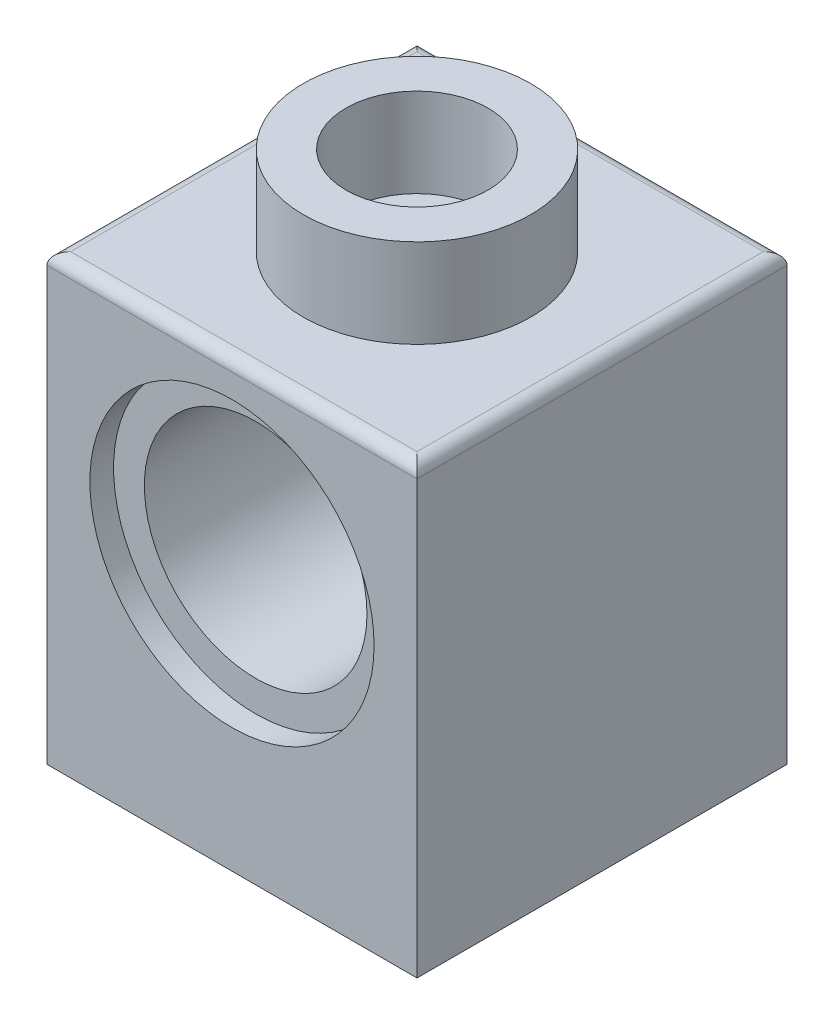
ISO-10303-21;
HEADER;
FILE_DESCRIPTION(('STEP AP214'),'2;1');
FILE_NAME('part.step','',(''),(''),'','','');
FILE_SCHEMA(('AUTOMOTIVE_DESIGN { 1 0 10303 214 1 1 1 1 }'));
ENDSEC;
DATA;
#1=APPLICATION_CONTEXT('core data for automotive mechanical design processes');
#2=APPLICATION_PROTOCOL_DEFINITION('international standard','automotive_design',2000,#1);
#3=PRODUCT_CONTEXT('',#1,'mechanical');
#4=PRODUCT('Part','Part','',(#3));
#5=PRODUCT_RELATED_PRODUCT_CATEGORY('part','',(#4));
#6=PRODUCT_DEFINITION_FORMATION('','',#4);
#7=PRODUCT_DEFINITION_CONTEXT('part definition',#1,'design');
#8=PRODUCT_DEFINITION('design','',#6,#7);
#9=PRODUCT_DEFINITION_SHAPE('','',#8);
#10=(LENGTH_UNIT() NAMED_UNIT(*) SI_UNIT(.MILLI.,.METRE.));
#11=(NAMED_UNIT(*) PLANE_ANGLE_UNIT() SI_UNIT($,.RADIAN.));
#12=(NAMED_UNIT(*) SI_UNIT($,.STERADIAN.) SOLID_ANGLE_UNIT());
#13=UNCERTAINTY_MEASURE_WITH_UNIT(LENGTH_MEASURE(1.E-05),#10,'distance_accuracy_value','');
#14=(GEOMETRIC_REPRESENTATION_CONTEXT(3) GLOBAL_UNCERTAINTY_ASSIGNED_CONTEXT((#13)) GLOBAL_UNIT_ASSIGNED_CONTEXT((#10,
#11,#12)) REPRESENTATION_CONTEXT('',''));
#15=CARTESIAN_POINT('',(0.,0.,0.));
#16=DIRECTION('',(0.,0.,1.));
#17=DIRECTION('',(1.,0.,0.));
#18=AXIS2_PLACEMENT_3D('',#15,#16,#17);
#19=CARTESIAN_POINT('',(0.,5.715,-3.96875));
#20=DIRECTION('',(0.,0.,1.));
#21=DIRECTION('',(1.,0.,0.));
#22=AXIS2_PLACEMENT_3D('',#19,#20,#21);
#23=CYLINDRICAL_SURFACE('',#22,2.3876);
#24=CARTESIAN_POINT('',(0.,5.715,3.46075));
#25=DIRECTION('',(0.,0.,1.));
#26=DIRECTION('',(1.,0.,0.));
#27=AXIS2_PLACEMENT_3D('',#24,#25,#26);
#28=CIRCLE('',#27,2.3876);
#29=CARTESIAN_POINT('',(2.3876,5.715,3.46075));
#30=VERTEX_POINT('',#29);
#31=EDGE_CURVE('E145',#30,#30,#28,.F.);
#32=ORIENTED_EDGE('',*,*,#31,.F.);
#33=EDGE_LOOP('',(#32));
#34=FACE_BOUND('',#33,.T.);
#35=CARTESIAN_POINT('',(0.,5.715,-3.20675));
#36=DIRECTION('',(0.,0.,-1.));
#37=DIRECTION('',(-1.,0.,0.));
#38=AXIS2_PLACEMENT_3D('',#35,#36,#37);
#39=CIRCLE('',#38,2.3876);
#40=CARTESIAN_POINT('',(-2.3876,5.715,-3.20675));
#41=VERTEX_POINT('',#40);
#42=EDGE_CURVE('E181',#41,#41,#39,.F.);
#43=ORIENTED_EDGE('',*,*,#42,.F.);
#44=EDGE_LOOP('',(#43));
#45=FACE_BOUND('',#44,.T.);
#46=ADVANCED_FACE('F34',(#34,#45),#23,.F.);
#47=CARTESIAN_POINT('',(2.38125,9.525,3.96875));
#48=DIRECTION('',(-1.,0.,0.));
#49=DIRECTION('',(0.,0.,1.));
#50=AXIS2_PLACEMENT_3D('',#47,#48,#49);
#51=PLANE('',#50);
#52=DIRECTION('',(0.,0.,1.));
#53=VECTOR('',#52,1.);
#54=CARTESIAN_POINT('',(2.38125,3.30554317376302,-11.9628297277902));
#55=LINE('',#54,#53);
#56=CARTESIAN_POINT('',(2.38125,3.30554317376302,-2.38125));
#57=VERTEX_POINT('',#56);
#58=CARTESIAN_POINT('',(2.38125,3.30554317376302,2.38125));
#59=VERTEX_POINT('',#58);
#60=EDGE_CURVE('E112',#57,#59,#55,.T.);
#61=ORIENTED_EDGE('',*,*,#60,.F.);
#62=DIRECTION('',(0.,-1.,0.));
#63=VECTOR('',#62,1.);
#64=CARTESIAN_POINT('',(2.38125,9.525,-2.38125));
#65=LINE('',#64,#63);
#66=CARTESIAN_POINT('',(2.38125,0.,-2.38125));
#67=VERTEX_POINT('',#66);
#68=EDGE_CURVE('E126',#57,#67,#65,.T.);
#69=ORIENTED_EDGE('',*,*,#68,.T.);
#70=DIRECTION('',(0.,0.,-1.));
#71=VECTOR('',#70,1.);
#72=CARTESIAN_POINT('',(2.38125,0.,3.96875));
#73=LINE('',#72,#71);
#74=CARTESIAN_POINT('',(2.38125,0.,2.38125));
#75=VERTEX_POINT('',#74);
#76=EDGE_CURVE('E147',#75,#67,#73,.T.);
#77=ORIENTED_EDGE('',*,*,#76,.F.);
#78=DIRECTION('',(0.,-1.,0.));
#79=VECTOR('',#78,1.);
#80=CARTESIAN_POINT('',(2.38125,9.525,2.38125));
#81=LINE('',#80,#79);
#82=EDGE_CURVE('E128',#59,#75,#81,.T.);
#83=ORIENTED_EDGE('',*,*,#82,.F.);
#84=EDGE_LOOP('',(#61,#69,#77,#83));
#85=FACE_BOUND('',#84,.T.);
#86=ADVANCED_FACE('F124',(#85),#51,.T.);
#87=CARTESIAN_POINT('',(-3.96875,0.,3.96875));
#88=DIRECTION('',(0.,-1.,0.));
#89=DIRECTION('',(0.,0.,-1.));
#90=AXIS2_PLACEMENT_3D('',#87,#88,#89);
#91=PLANE('',#90);
#92=DIRECTION('',(0.,0.,1.));
#93=VECTOR('',#92,1.);
#94=CARTESIAN_POINT('',(-3.96875,0.,-3.96875));
#95=LINE('',#94,#93);
#96=CARTESIAN_POINT('',(-3.96875,0.,-3.96875));
#97=VERTEX_POINT('',#96);
#98=CARTESIAN_POINT('',(-3.96875,0.,3.96875));
#99=VERTEX_POINT('',#98);
#100=EDGE_CURVE('E154',#97,#99,#95,.T.);
#101=ORIENTED_EDGE('',*,*,#100,.F.);
#102=DIRECTION('',(1.,0.,0.));
#103=VECTOR('',#102,1.);
#104=CARTESIAN_POINT('',(-3.96875,0.,-3.96875));
#105=LINE('',#104,#103);
#106=CARTESIAN_POINT('',(3.96875,0.,-3.96875));
#107=VERTEX_POINT('',#106);
#108=EDGE_CURVE('E163',#97,#107,#105,.T.);
#109=ORIENTED_EDGE('',*,*,#108,.T.);
#110=DIRECTION('',(0.,0.,-1.));
#111=VECTOR('',#110,1.);
#112=CARTESIAN_POINT('',(3.96875,0.,3.96875));
#113=LINE('',#112,#111);
#114=CARTESIAN_POINT('',(3.96875,0.,3.96875));
#115=VERTEX_POINT('',#114);
#116=EDGE_CURVE('E160',#115,#107,#113,.T.);
#117=ORIENTED_EDGE('',*,*,#116,.F.);
#118=DIRECTION('',(-1.,0.,0.));
#119=VECTOR('',#118,1.);
#120=CARTESIAN_POINT('',(3.96875,0.,3.96875));
#121=LINE('',#120,#119);
#122=EDGE_CURVE('E157',#115,#99,#121,.T.);
#123=ORIENTED_EDGE('',*,*,#122,.T.);
#124=EDGE_LOOP('',(#101,#109,#117,#123));
#125=FACE_BOUND('',#124,.T.);
#126=DIRECTION('',(1.,0.,0.));
#127=VECTOR('',#126,1.);
#128=CARTESIAN_POINT('',(-3.96875,0.,-2.38125));
#129=LINE('',#128,#127);
#130=CARTESIAN_POINT('',(-2.38125,0.,-2.38125));
#131=VERTEX_POINT('',#130);
#132=EDGE_CURVE('E133',#131,#67,#129,.T.);
#133=ORIENTED_EDGE('',*,*,#132,.F.);
#134=DIRECTION('',(0.,0.,1.));
#135=VECTOR('',#134,1.);
#136=CARTESIAN_POINT('',(-2.38125,0.,3.96875));
#137=LINE('',#136,#135);
#138=CARTESIAN_POINT('',(-2.38125,0.,2.38125));
#139=VERTEX_POINT('',#138);
#140=EDGE_CURVE('E141',#131,#139,#137,.T.);
#141=ORIENTED_EDGE('',*,*,#140,.T.);
#142=DIRECTION('',(-1.,0.,0.));
#143=VECTOR('',#142,1.);
#144=CARTESIAN_POINT('',(-3.96875,0.,2.38125));
#145=LINE('',#144,#143);
#146=EDGE_CURVE('E144',#75,#139,#145,.T.);
#147=ORIENTED_EDGE('',*,*,#146,.F.);
#148=ORIENTED_EDGE('',*,*,#76,.T.);
#149=EDGE_LOOP('',(#133,#141,#147,#148));
#150=FACE_BOUND('',#149,.T.);
#151=ADVANCED_FACE('F240',(#125,#150),#91,.T.);
#152=CARTESIAN_POINT('',(-3.96875,9.525,3.96875));
#153=DIRECTION('',(0.,-1.,0.));
#154=DIRECTION('',(0.,0.,-1.));
#155=AXIS2_PLACEMENT_3D('',#152,#153,#154);
#156=PLANE('',#155);
#157=DIRECTION('',(0.,0.,-1.));
#158=VECTOR('',#157,1.);
#159=CARTESIAN_POINT('',(3.71475,9.525,3.96875));
#160=LINE('',#159,#158);
#161=CARTESIAN_POINT('',(3.71475,9.525,3.71475));
#162=VERTEX_POINT('',#161);
#163=CARTESIAN_POINT('',(3.71475,9.525,-3.71475));
#164=VERTEX_POINT('',#163);
#165=EDGE_CURVE('E563',#162,#164,#160,.T.);
#166=ORIENTED_EDGE('',*,*,#165,.T.);
#167=DIRECTION('',(1.,0.,0.));
#168=VECTOR('',#167,1.);
#169=CARTESIAN_POINT('',(-3.96875,9.525,-3.71475));
#170=LINE('',#169,#168);
#171=CARTESIAN_POINT('',(-3.71475,9.525,-3.71475));
#172=VERTEX_POINT('',#171);
#173=EDGE_CURVE('E590',#164,#172,#170,.F.);
#174=ORIENTED_EDGE('',*,*,#173,.T.);
#175=DIRECTION('',(0.,0.,1.));
#176=VECTOR('',#175,1.);
#177=CARTESIAN_POINT('',(-3.71475,9.525,3.96875));
#178=LINE('',#177,#176);
#179=CARTESIAN_POINT('',(-3.71475,9.525,3.71475));
#180=VERTEX_POINT('',#179);
#181=EDGE_CURVE('E585',#172,#180,#178,.T.);
#182=ORIENTED_EDGE('',*,*,#181,.T.);
#183=DIRECTION('',(-1.,0.,0.));
#184=VECTOR('',#183,1.);
#185=CARTESIAN_POINT('',(3.96875,9.525,3.71475));
#186=LINE('',#185,#184);
#187=EDGE_CURVE('E587',#180,#162,#186,.F.);
#188=ORIENTED_EDGE('',*,*,#187,.T.);
#189=EDGE_LOOP('',(#166,#174,#182,#188));
#190=FACE_BOUND('',#189,.T.);
#191=CARTESIAN_POINT('',(0.,9.525,0.));
#192=DIRECTION('',(0.,-1.,0.));
#193=DIRECTION('',(0.,0.,-1.));
#194=AXIS2_PLACEMENT_3D('',#191,#192,#193);
#195=CIRCLE('',#194,2.4384);
#196=CARTESIAN_POINT('',(0.,9.525,-2.4384));
#197=VERTEX_POINT('',#196);
#198=EDGE_CURVE('E174',#197,#197,#195,.F.);
#199=ORIENTED_EDGE('',*,*,#198,.F.);
#200=EDGE_LOOP('',(#199));
#201=FACE_BOUND('',#200,.T.);
#202=ADVANCED_FACE('F387',(#190,#201),#156,.F.);
#203=CARTESIAN_POINT('',(-3.96875,9.525,-3.96875));
#204=DIRECTION('',(1.,0.,0.));
#205=DIRECTION('',(0.,0.,-1.));
#206=AXIS2_PLACEMENT_3D('',#203,#204,#205);
#207=PLANE('',#206);
#208=DIRECTION('',(0.,-1.,0.));
#209=VECTOR('',#208,1.);
#210=CARTESIAN_POINT('',(-3.96875,9.525,3.96875));
#211=LINE('',#210,#209);
#212=CARTESIAN_POINT('',(-3.96875,9.271,3.96875));
#213=VERTEX_POINT('',#212);
#214=EDGE_CURVE('E172',#213,#99,#211,.T.);
#215=ORIENTED_EDGE('',*,*,#214,.F.);
#216=DIRECTION('',(0.,0.,1.));
#217=VECTOR('',#216,1.);
#218=CARTESIAN_POINT('',(-3.96875,9.271,-3.96875));
#219=LINE('',#218,#217);
#220=CARTESIAN_POINT('',(-3.96875,9.271,-3.96875));
#221=VERTEX_POINT('',#220);
#222=EDGE_CURVE('E11',#213,#221,#219,.F.);
#223=ORIENTED_EDGE('',*,*,#222,.T.);
#224=DIRECTION('',(0.,-1.,0.));
#225=VECTOR('',#224,1.);
#226=CARTESIAN_POINT('',(-3.96875,9.525,-3.96875));
#227=LINE('',#226,#225);
#228=EDGE_CURVE('E166',#221,#97,#227,.T.);
#229=ORIENTED_EDGE('',*,*,#228,.T.);
#230=ORIENTED_EDGE('',*,*,#100,.T.);
#231=EDGE_LOOP('',(#215,#223,#229,#230));
#232=FACE_BOUND('',#231,.T.);
#233=ADVANCED_FACE('F36',(#232),#207,.F.);
#234=CARTESIAN_POINT('',(3.96875,9.525,3.96875));
#235=DIRECTION('',(0.,0.,1.));
#236=DIRECTION('',(1.,0.,0.));
#237=AXIS2_PLACEMENT_3D('',#234,#235,#236);
#238=PLANE('',#237);
#239=CARTESIAN_POINT('',(0.,5.715,3.96875));
#240=DIRECTION('',(0.,0.,1.));
#241=DIRECTION('',(1.,0.,0.));
#242=AXIS2_PLACEMENT_3D('',#239,#240,#241);
#243=CIRCLE('',#242,3.048);
#244=CARTESIAN_POINT('',(3.048,5.715,3.96875));
#245=VERTEX_POINT('',#244);
#246=EDGE_CURVE('E184',#245,#245,#243,.T.);
#247=ORIENTED_EDGE('',*,*,#246,.F.);
#248=EDGE_LOOP('',(#247));
#249=FACE_BOUND('',#248,.T.);
#250=DIRECTION('',(0.,-1.,0.));
#251=VECTOR('',#250,1.);
#252=CARTESIAN_POINT('',(3.96875,9.525,3.96875));
#253=LINE('',#252,#251);
#254=CARTESIAN_POINT('',(3.96875,9.271,3.96875));
#255=VERTEX_POINT('',#254);
#256=EDGE_CURVE('E170',#255,#115,#253,.T.);
#257=ORIENTED_EDGE('',*,*,#256,.F.);
#258=DIRECTION('',(-1.,0.,0.));
#259=VECTOR('',#258,1.);
#260=CARTESIAN_POINT('',(-3.96875,9.271,3.96875));
#261=LINE('',#260,#259);
#262=EDGE_CURVE('E42',#255,#213,#261,.T.);
#263=ORIENTED_EDGE('',*,*,#262,.T.);
#264=ORIENTED_EDGE('',*,*,#214,.T.);
#265=ORIENTED_EDGE('',*,*,#122,.F.);
#266=EDGE_LOOP('',(#257,#263,#264,#265));
#267=FACE_BOUND('',#266,.T.);
#268=ADVANCED_FACE('F368',(#249,#267),#238,.T.);
#269=CARTESIAN_POINT('',(3.96875,9.525,3.96875));
#270=DIRECTION('',(-1.,0.,0.));
#271=DIRECTION('',(0.,0.,1.));
#272=AXIS2_PLACEMENT_3D('',#269,#270,#271);
#273=PLANE('',#272);
#274=DIRECTION('',(0.,-1.,0.));
#275=VECTOR('',#274,1.);
#276=CARTESIAN_POINT('',(3.96875,9.525,-3.96875));
#277=LINE('',#276,#275);
#278=CARTESIAN_POINT('',(3.96875,9.271,-3.96875));
#279=VERTEX_POINT('',#278);
#280=EDGE_CURVE('E168',#279,#107,#277,.T.);
#281=ORIENTED_EDGE('',*,*,#280,.F.);
#282=DIRECTION('',(0.,0.,-1.));
#283=VECTOR('',#282,1.);
#284=CARTESIAN_POINT('',(3.96875,9.271,3.96875));
#285=LINE('',#284,#283);
#286=EDGE_CURVE('E56',#279,#255,#285,.F.);
#287=ORIENTED_EDGE('',*,*,#286,.T.);
#288=ORIENTED_EDGE('',*,*,#256,.T.);
#289=ORIENTED_EDGE('',*,*,#116,.T.);
#290=EDGE_LOOP('',(#281,#287,#288,#289));
#291=FACE_BOUND('',#290,.T.);
#292=ADVANCED_FACE('F355',(#291),#273,.F.);
#293=CARTESIAN_POINT('',(-3.96875,9.525,-3.96875));
#294=DIRECTION('',(0.,0.,-1.));
#295=DIRECTION('',(-1.,0.,0.));
#296=AXIS2_PLACEMENT_3D('',#293,#294,#295);
#297=PLANE('',#296);
#298=CARTESIAN_POINT('',(0.,5.715,-3.96875));
#299=DIRECTION('',(0.,0.,-1.));
#300=DIRECTION('',(-1.,0.,0.));
#301=AXIS2_PLACEMENT_3D('',#298,#299,#300);
#302=CIRCLE('',#301,3.048);
#303=CARTESIAN_POINT('',(-3.048,5.715,-3.96875));
#304=VERTEX_POINT('',#303);
#305=EDGE_CURVE('E129',#304,#304,#302,.T.);
#306=ORIENTED_EDGE('',*,*,#305,.F.);
#307=EDGE_LOOP('',(#306));
#308=FACE_BOUND('',#307,.T.);
#309=ORIENTED_EDGE('',*,*,#228,.F.);
#310=DIRECTION('',(1.,0.,0.));
#311=VECTOR('',#310,1.);
#312=CARTESIAN_POINT('',(3.96875,9.271,-3.96875));
#313=LINE('',#312,#311);
#314=EDGE_CURVE('E583',#221,#279,#313,.T.);
#315=ORIENTED_EDGE('',*,*,#314,.T.);
#316=ORIENTED_EDGE('',*,*,#280,.T.);
#317=ORIENTED_EDGE('',*,*,#108,.F.);
#318=EDGE_LOOP('',(#309,#315,#316,#317));
#319=FACE_BOUND('',#318,.T.);
#320=ADVANCED_FACE('F348',(#308,#319),#297,.T.);
#321=CARTESIAN_POINT('',(0.,11.43,0.));
#322=DIRECTION('',(0.,-1.,0.));
#323=DIRECTION('',(0.,0.,-1.));
#324=AXIS2_PLACEMENT_3D('',#321,#322,#323);
#325=CYLINDRICAL_SURFACE('',#324,2.4384);
#326=CARTESIAN_POINT('',(0.,11.43,0.));
#327=DIRECTION('',(0.,1.,0.));
#328=DIRECTION('',(0.,0.,1.));
#329=AXIS2_PLACEMENT_3D('',#326,#327,#328);
#330=CIRCLE('',#329,2.4384);
#331=CARTESIAN_POINT('',(0.,11.43,-2.4384));
#332=VERTEX_POINT('',#331);
#333=EDGE_CURVE('E151',#332,#332,#330,.T.);
#334=CARTESIAN_POINT('',(0.,11.43,-2.4384));
#335=CARTESIAN_POINT('',(0.,11.41015625,-2.4384));
#336=CARTESIAN_POINT('',(0.,11.3903125,-2.4384));
#337=CARTESIAN_POINT('',(0.,11.350625,-2.4384));
#338=CARTESIAN_POINT('',(0.,11.33078125,-2.4384));
#339=CARTESIAN_POINT('',(0.,11.29109375,-2.4384));
#340=CARTESIAN_POINT('',(0.,11.27125,-2.4384));
#341=CARTESIAN_POINT('',(0.,11.2315625,-2.4384));
#342=CARTESIAN_POINT('',(0.,11.21171875,-2.4384));
#343=CARTESIAN_POINT('',(0.,11.17203125,-2.4384));
#344=CARTESIAN_POINT('',(0.,11.1521875,-2.4384));
#345=CARTESIAN_POINT('',(0.,11.1125,-2.4384));
#346=CARTESIAN_POINT('',(0.,11.09265625,-2.4384));
#347=CARTESIAN_POINT('',(0.,11.05296875,-2.4384));
#348=CARTESIAN_POINT('',(0.,11.033125,-2.4384));
#349=CARTESIAN_POINT('',(0.,10.9934375,-2.4384));
#350=CARTESIAN_POINT('',(0.,10.97359375,-2.4384));
#351=CARTESIAN_POINT('',(0.,10.93390625,-2.4384));
#352=CARTESIAN_POINT('',(0.,10.9140625,-2.4384));
#353=CARTESIAN_POINT('',(0.,10.874375,-2.4384));
#354=CARTESIAN_POINT('',(0.,10.85453125,-2.4384));
#355=CARTESIAN_POINT('',(0.,10.81484375,-2.4384));
#356=CARTESIAN_POINT('',(0.,10.795,-2.4384));
#357=CARTESIAN_POINT('',(0.,10.7553125,-2.4384));
#358=CARTESIAN_POINT('',(0.,10.73546875,-2.4384));
#359=CARTESIAN_POINT('',(0.,10.69578125,-2.4384));
#360=CARTESIAN_POINT('',(0.,10.6759375,-2.4384));
#361=CARTESIAN_POINT('',(0.,10.63625,-2.4384));
#362=CARTESIAN_POINT('',(0.,10.61640625,-2.4384));
#363=CARTESIAN_POINT('',(0.,10.57671875,-2.4384));
#364=CARTESIAN_POINT('',(0.,10.556875,-2.4384));
#365=CARTESIAN_POINT('',(0.,10.5171875,-2.4384));
#366=CARTESIAN_POINT('',(0.,10.49734375,-2.4384));
#367=CARTESIAN_POINT('',(0.,10.45765625,-2.4384));
#368=CARTESIAN_POINT('',(0.,10.4378125,-2.4384));
#369=CARTESIAN_POINT('',(0.,10.398125,-2.4384));
#370=CARTESIAN_POINT('',(0.,10.37828125,-2.4384));
#371=CARTESIAN_POINT('',(0.,10.33859375,-2.4384));
#372=CARTESIAN_POINT('',(0.,10.31875,-2.4384));
#373=CARTESIAN_POINT('',(0.,10.2790625,-2.4384));
#374=CARTESIAN_POINT('',(0.,10.25921875,-2.4384));
#375=CARTESIAN_POINT('',(0.,10.21953125,-2.4384));
#376=CARTESIAN_POINT('',(0.,10.1996875,-2.4384));
#377=CARTESIAN_POINT('',(0.,10.16,-2.4384));
#378=CARTESIAN_POINT('',(0.,10.14015625,-2.4384));
#379=CARTESIAN_POINT('',(0.,10.10046875,-2.4384));
#380=CARTESIAN_POINT('',(0.,10.080625,-2.4384));
#381=CARTESIAN_POINT('',(0.,10.0409375,-2.4384));
#382=CARTESIAN_POINT('',(0.,10.02109375,-2.4384));
#383=CARTESIAN_POINT('',(0.,9.98140625,-2.4384));
#384=CARTESIAN_POINT('',(0.,9.9615625,-2.4384));
#385=CARTESIAN_POINT('',(0.,9.921875,-2.4384));
#386=CARTESIAN_POINT('',(0.,9.90203125,-2.4384));
#387=CARTESIAN_POINT('',(0.,9.86234375,-2.4384));
#388=CARTESIAN_POINT('',(0.,9.8425,-2.4384));
#389=CARTESIAN_POINT('',(0.,9.8028125,-2.4384));
#390=CARTESIAN_POINT('',(0.,9.78296875,-2.4384));
#391=CARTESIAN_POINT('',(0.,9.74328125,-2.4384));
#392=CARTESIAN_POINT('',(0.,9.7234375,-2.4384));
#393=CARTESIAN_POINT('',(0.,9.68375,-2.4384));
#394=CARTESIAN_POINT('',(0.,9.66390625,-2.4384));
#395=CARTESIAN_POINT('',(0.,9.62421875,-2.4384));
#396=CARTESIAN_POINT('',(0.,9.604375,-2.4384));
#397=CARTESIAN_POINT('',(0.,9.5646875,-2.4384));
#398=CARTESIAN_POINT('',(0.,9.54484375,-2.4384));
#399=CARTESIAN_POINT('',(0.,9.525,-2.4384));
#400=B_SPLINE_CURVE_WITH_KNOTS('',3,(#334,#335,#336,#337,#338,#339,#340,#341,#342,#343,#344,
#345,#346,#347,#348,#349,#350,#351,#352,#353,#354,#355,#356,#357,#358,#359,#360,#361,#362,#363,
#364,#365,#366,#367,#368,#369,#370,#371,#372,#373,#374,#375,#376,#377,#378,#379,#380,#381,#382,
#383,#384,#385,#386,#387,#388,#389,#390,#391,#392,#393,#394,#395,#396,#397,#398,#399),
.UNSPECIFIED.,.F.,.F.,(4,2,2,2,2,2,2,2,2,2,2,2,2,2,2,2,2,2,2,2,2,2,2,2,2,2,2,2,2,2,2,2,4),(0.,
0.0595312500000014,0.119062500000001,0.178593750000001,0.238125,0.29765625,0.3571875,
0.416718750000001,0.476250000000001,0.535781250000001,0.5953125,0.65484375,0.714375,
0.773906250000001,0.833437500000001,0.892968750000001,0.9525,1.01203125,1.0715625,1.13109375,
1.190625,1.25015625,1.3096875,1.36921875,1.42875,1.48828125,1.5478125,1.60734375,1.666875,
1.72640625,1.7859375,1.84546875,1.905),.UNSPECIFIED.);
#401=EDGE_CURVE('BSEAM354',#332,#197,#400,.T.);
#402=ORIENTED_EDGE('',*,*,#333,.F.);
#403=ORIENTED_EDGE('',*,*,#198,.T.);
#404=ORIENTED_EDGE('',*,*,#401,.T.);
#405=ORIENTED_EDGE('',*,*,#401,.F.);
#406=EDGE_LOOP('',(#402,#404,#403,#405));
#407=FACE_BOUND('',#406,.T.);
#408=ADVANCED_FACE('F354',(#407),#325,.T.);
#409=CARTESIAN_POINT('',(0.,11.43,0.));
#410=DIRECTION('',(0.,1.,0.));
#411=DIRECTION('',(0.,0.,1.));
#412=AXIS2_PLACEMENT_3D('',#409,#410,#411);
#413=PLANE('',#412);
#414=CARTESIAN_POINT('',(0.,11.43,0.));
#415=DIRECTION('',(0.,1.,0.));
#416=DIRECTION('',(0.,0.,1.));
#417=AXIS2_PLACEMENT_3D('',#414,#415,#416);
#418=CIRCLE('',#417,1.524);
#419=CARTESIAN_POINT('',(0.,11.43,1.524));
#420=VERTEX_POINT('',#419);
#421=EDGE_CURVE('E566',#420,#420,#418,.T.);
#422=ORIENTED_EDGE('',*,*,#421,.F.);
#423=EDGE_LOOP('',(#422));
#424=FACE_BOUND('',#423,.T.);
#425=ORIENTED_EDGE('',*,*,#333,.T.);
#426=EDGE_LOOP('',(#425));
#427=FACE_BOUND('',#426,.T.);
#428=ADVANCED_FACE('F234',(#424,#427),#413,.T.);
#429=CARTESIAN_POINT('',(-2.38125,9.525,-3.96875));
#430=DIRECTION('',(1.,0.,0.));
#431=DIRECTION('',(0.,0.,-1.));
#432=AXIS2_PLACEMENT_3D('',#429,#430,#431);
#433=PLANE('',#432);
#434=DIRECTION('',(0.,0.,1.));
#435=VECTOR('',#434,1.);
#436=CARTESIAN_POINT('',(-2.38125,3.30554317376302,-11.9628297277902));
#437=LINE('',#436,#435);
#438=CARTESIAN_POINT('',(-2.38125,3.30554317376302,2.38125));
#439=VERTEX_POINT('',#438);
#440=CARTESIAN_POINT('',(-2.38125,3.30554317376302,-2.38125));
#441=VERTEX_POINT('',#440);
#442=EDGE_CURVE('E115',#439,#441,#437,.F.);
#443=ORIENTED_EDGE('',*,*,#442,.F.);
#444=DIRECTION('',(0.,-1.,0.));
#445=VECTOR('',#444,1.);
#446=CARTESIAN_POINT('',(-2.38125,9.525,2.38125));
#447=LINE('',#446,#445);
#448=EDGE_CURVE('E137',#439,#139,#447,.T.);
#449=ORIENTED_EDGE('',*,*,#448,.T.);
#450=ORIENTED_EDGE('',*,*,#140,.F.);
#451=DIRECTION('',(0.,-1.,0.));
#452=VECTOR('',#451,1.);
#453=CARTESIAN_POINT('',(-2.38125,9.525,-2.38125));
#454=LINE('',#453,#452);
#455=EDGE_CURVE('E135',#441,#131,#454,.T.);
#456=ORIENTED_EDGE('',*,*,#455,.F.);
#457=EDGE_LOOP('',(#443,#449,#450,#456));
#458=FACE_BOUND('',#457,.T.);
#459=ADVANCED_FACE('F230',(#458),#433,.T.);
#460=CARTESIAN_POINT('',(3.96875,9.525,2.38125));
#461=DIRECTION('',(0.,0.,1.));
#462=DIRECTION('',(1.,0.,0.));
#463=AXIS2_PLACEMENT_3D('',#460,#461,#462);
#464=PLANE('',#463);
#465=ORIENTED_EDGE('',*,*,#448,.F.);
#466=CARTESIAN_POINT('',(0.,5.715,2.38125));
#467=DIRECTION('',(0.,0.,1.));
#468=DIRECTION('',(1.,0.,0.));
#469=AXIS2_PLACEMENT_3D('',#466,#467,#468);
#470=CIRCLE('',#469,3.3876);
#471=EDGE_CURVE('E119',#439,#59,#470,.T.);
#472=ORIENTED_EDGE('',*,*,#471,.T.);
#473=ORIENTED_EDGE('',*,*,#82,.T.);
#474=ORIENTED_EDGE('',*,*,#146,.T.);
#475=EDGE_LOOP('',(#465,#472,#473,#474));
#476=FACE_BOUND('',#475,.T.);
#477=ADVANCED_FACE('F233',(#476),#464,.F.);
#478=CARTESIAN_POINT('',(-3.96875,9.525,-2.38125));
#479=DIRECTION('',(0.,0.,-1.));
#480=DIRECTION('',(-1.,0.,0.));
#481=AXIS2_PLACEMENT_3D('',#478,#479,#480);
#482=PLANE('',#481);
#483=ORIENTED_EDGE('',*,*,#68,.F.);
#484=CARTESIAN_POINT('',(0.,5.715,-2.38125));
#485=DIRECTION('',(0.,0.,1.));
#486=DIRECTION('',(1.,0.,0.));
#487=AXIS2_PLACEMENT_3D('',#484,#485,#486);
#488=CIRCLE('',#487,3.3876);
#489=EDGE_CURVE('E109',#57,#441,#488,.F.);
#490=ORIENTED_EDGE('',*,*,#489,.T.);
#491=ORIENTED_EDGE('',*,*,#455,.T.);
#492=ORIENTED_EDGE('',*,*,#132,.T.);
#493=EDGE_LOOP('',(#483,#490,#491,#492));
#494=FACE_BOUND('',#493,.T.);
#495=ADVANCED_FACE('F131',(#494),#482,.F.);
#496=CARTESIAN_POINT('',(0.,5.715,3.46075));
#497=DIRECTION('',(0.,0.,1.));
#498=DIRECTION('',(1.,0.,0.));
#499=AXIS2_PLACEMENT_3D('',#496,#497,#498);
#500=PLANE('',#499);
#501=CARTESIAN_POINT('',(0.,5.715,3.46075));
#502=DIRECTION('',(0.,0.,1.));
#503=DIRECTION('',(1.,0.,0.));
#504=AXIS2_PLACEMENT_3D('',#501,#502,#503);
#505=CIRCLE('',#504,3.048);
#506=CARTESIAN_POINT('',(3.048,5.715,3.46075));
#507=VERTEX_POINT('',#506);
#508=EDGE_CURVE('E180',#507,#507,#505,.T.);
#509=ORIENTED_EDGE('',*,*,#508,.T.);
#510=EDGE_LOOP('',(#509));
#511=FACE_BOUND('',#510,.T.);
#512=ORIENTED_EDGE('',*,*,#31,.T.);
#513=EDGE_LOOP('',(#512));
#514=FACE_BOUND('',#513,.T.);
#515=ADVANCED_FACE('F220',(#511,#514),#500,.T.);
#516=CARTESIAN_POINT('',(0.,5.715,3.46075));
#517=DIRECTION('',(0.,0.,1.));
#518=DIRECTION('',(1.,0.,0.));
#519=AXIS2_PLACEMENT_3D('',#516,#517,#518);
#520=CYLINDRICAL_SURFACE('',#519,3.048);
#521=ORIENTED_EDGE('',*,*,#508,.F.);
#522=EDGE_LOOP('',(#521));
#523=FACE_BOUND('',#522,.T.);
#524=ORIENTED_EDGE('',*,*,#246,.T.);
#525=EDGE_LOOP('',(#524));
#526=FACE_BOUND('',#525,.T.);
#527=ADVANCED_FACE('F215',(#523,#526),#520,.F.);
#528=CARTESIAN_POINT('',(0.,5.715,-3.20675));
#529=DIRECTION('',(0.,0.,-1.));
#530=DIRECTION('',(-1.,0.,0.));
#531=AXIS2_PLACEMENT_3D('',#528,#529,#530);
#532=PLANE('',#531);
#533=CARTESIAN_POINT('',(0.,5.715,-3.20675));
#534=DIRECTION('',(0.,0.,-1.));
#535=DIRECTION('',(-1.,0.,0.));
#536=AXIS2_PLACEMENT_3D('',#533,#534,#535);
#537=CIRCLE('',#536,3.048);
#538=CARTESIAN_POINT('',(-3.048,5.715,-3.20675));
#539=VERTEX_POINT('',#538);
#540=EDGE_CURVE('E185',#539,#539,#537,.T.);
#541=ORIENTED_EDGE('',*,*,#540,.T.);
#542=EDGE_LOOP('',(#541));
#543=FACE_BOUND('',#542,.T.);
#544=ORIENTED_EDGE('',*,*,#42,.T.);
#545=EDGE_LOOP('',(#544));
#546=FACE_BOUND('',#545,.T.);
#547=ADVANCED_FACE('F210',(#543,#546),#532,.T.);
#548=CARTESIAN_POINT('',(0.,5.715,-3.20675));
#549=DIRECTION('',(0.,0.,-1.));
#550=DIRECTION('',(-1.,0.,0.));
#551=AXIS2_PLACEMENT_3D('',#548,#549,#550);
#552=CYLINDRICAL_SURFACE('',#551,3.048);
#553=CARTESIAN_POINT('',(-3.048,5.715,-3.20675));
#554=CARTESIAN_POINT('',(-3.048,5.715,-3.2146875));
#555=CARTESIAN_POINT('',(-3.048,5.715,-3.222625));
#556=CARTESIAN_POINT('',(-3.048,5.715,-3.2385));
#557=CARTESIAN_POINT('',(-3.048,5.715,-3.2464375));
#558=CARTESIAN_POINT('',(-3.048,5.715,-3.2623125));
#559=CARTESIAN_POINT('',(-3.048,5.715,-3.27025));
#560=CARTESIAN_POINT('',(-3.048,5.715,-3.286125));
#561=CARTESIAN_POINT('',(-3.048,5.715,-3.2940625));
#562=CARTESIAN_POINT('',(-3.048,5.715,-3.3099375));
#563=CARTESIAN_POINT('',(-3.048,5.715,-3.317875));
#564=CARTESIAN_POINT('',(-3.048,5.715,-3.33375));
#565=CARTESIAN_POINT('',(-3.048,5.715,-3.3416875));
#566=CARTESIAN_POINT('',(-3.048,5.715,-3.3575625));
#567=CARTESIAN_POINT('',(-3.048,5.715,-3.3655));
#568=CARTESIAN_POINT('',(-3.048,5.715,-3.381375));
#569=CARTESIAN_POINT('',(-3.048,5.715,-3.3893125));
#570=CARTESIAN_POINT('',(-3.048,5.715,-3.4051875));
#571=CARTESIAN_POINT('',(-3.048,5.715,-3.413125));
#572=CARTESIAN_POINT('',(-3.048,5.715,-3.429));
#573=CARTESIAN_POINT('',(-3.048,5.715,-3.4369375));
#574=CARTESIAN_POINT('',(-3.048,5.715,-3.4528125));
#575=CARTESIAN_POINT('',(-3.048,5.715,-3.46075));
#576=CARTESIAN_POINT('',(-3.048,5.715,-3.476625));
#577=CARTESIAN_POINT('',(-3.048,5.715,-3.4845625));
#578=CARTESIAN_POINT('',(-3.048,5.715,-3.5004375));
#579=CARTESIAN_POINT('',(-3.048,5.715,-3.508375));
#580=CARTESIAN_POINT('',(-3.048,5.715,-3.52425));
#581=CARTESIAN_POINT('',(-3.048,5.715,-3.5321875));
#582=CARTESIAN_POINT('',(-3.048,5.715,-3.5480625));
#583=CARTESIAN_POINT('',(-3.048,5.715,-3.556));
#584=CARTESIAN_POINT('',(-3.048,5.715,-3.571875));
#585=CARTESIAN_POINT('',(-3.048,5.715,-3.5798125));
#586=CARTESIAN_POINT('',(-3.048,5.715,-3.5956875));
#587=CARTESIAN_POINT('',(-3.048,5.715,-3.603625));
#588=CARTESIAN_POINT('',(-3.048,5.715,-3.6195));
#589=CARTESIAN_POINT('',(-3.048,5.715,-3.6274375));
#590=CARTESIAN_POINT('',(-3.048,5.715,-3.6433125));
#591=CARTESIAN_POINT('',(-3.048,5.715,-3.65125));
#592=CARTESIAN_POINT('',(-3.048,5.715,-3.667125));
#593=CARTESIAN_POINT('',(-3.048,5.715,-3.6750625));
#594=CARTESIAN_POINT('',(-3.048,5.715,-3.6909375));
#595=CARTESIAN_POINT('',(-3.048,5.715,-3.698875));
#596=CARTESIAN_POINT('',(-3.048,5.715,-3.71475));
#597=CARTESIAN_POINT('',(-3.048,5.715,-3.7226875));
#598=CARTESIAN_POINT('',(-3.048,5.715,-3.7385625));
#599=CARTESIAN_POINT('',(-3.048,5.715,-3.7465));
#600=CARTESIAN_POINT('',(-3.048,5.715,-3.762375));
#601=CARTESIAN_POINT('',(-3.048,5.715,-3.7703125));
#602=CARTESIAN_POINT('',(-3.048,5.715,-3.7861875));
#603=CARTESIAN_POINT('',(-3.048,5.715,-3.794125));
#604=CARTESIAN_POINT('',(-3.048,5.715,-3.81));
#605=CARTESIAN_POINT('',(-3.048,5.715,-3.8179375));
#606=CARTESIAN_POINT('',(-3.048,5.715,-3.8338125));
#607=CARTESIAN_POINT('',(-3.048,5.715,-3.84175));
#608=CARTESIAN_POINT('',(-3.048,5.715,-3.857625));
#609=CARTESIAN_POINT('',(-3.048,5.715,-3.8655625));
#610=CARTESIAN_POINT('',(-3.048,5.715,-3.8814375));
#611=CARTESIAN_POINT('',(-3.048,5.715,-3.889375));
#612=CARTESIAN_POINT('',(-3.048,5.715,-3.90525));
#613=CARTESIAN_POINT('',(-3.048,5.715,-3.9131875));
#614=CARTESIAN_POINT('',(-3.048,5.715,-3.9290625));
#615=CARTESIAN_POINT('',(-3.048,5.715,-3.937));
#616=CARTESIAN_POINT('',(-3.048,5.715,-3.952875));
#617=CARTESIAN_POINT('',(-3.048,5.715,-3.9608125));
#618=CARTESIAN_POINT('',(-3.048,5.715,-3.96875));
#619=B_SPLINE_CURVE_WITH_KNOTS('',3,(#553,#554,#555,#556,#557,#558,#559,#560,#561,#562,#563,
#564,#565,#566,#567,#568,#569,#570,#571,#572,#573,#574,#575,#576,#577,#578,#579,#580,#581,#582,
#583,#584,#585,#586,#587,#588,#589,#590,#591,#592,#593,#594,#595,#596,#597,#598,#599,#600,#601,
#602,#603,#604,#605,#606,#607,#608,#609,#610,#611,#612,#613,#614,#615,#616,#617,#618),
.UNSPECIFIED.,.F.,.F.,(4,2,2,2,2,2,2,2,2,2,2,2,2,2,2,2,2,2,2,2,2,2,2,2,2,2,2,2,2,2,2,2,4),(0.,
0.0238125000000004,0.0476250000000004,0.0714375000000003,0.0952500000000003,0.1190625,0.142875,
0.1666875,0.1905,0.2143125,0.238125,0.2619375,0.28575,0.3095625,0.333375,0.3571875,0.381,
0.4048125,0.428625,0.4524375,0.47625,0.5000625,0.523875,0.5476875,0.5715,0.5953125,0.619125,
0.6429375,0.66675,0.6905625,0.714375,0.7381875,0.762),.UNSPECIFIED.);
#620=EDGE_CURVE('BSEAM214',#539,#304,#619,.T.);
#621=ORIENTED_EDGE('',*,*,#540,.F.);
#622=ORIENTED_EDGE('',*,*,#305,.T.);
#623=ORIENTED_EDGE('',*,*,#620,.T.);
#624=ORIENTED_EDGE('',*,*,#620,.F.);
#625=EDGE_LOOP('',(#621,#623,#622,#624));
#626=FACE_BOUND('',#625,.T.);
#627=ADVANCED_FACE('F214',(#626),#552,.F.);
#628=CARTESIAN_POINT('',(0.,5.715,-11.9628297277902));
#629=DIRECTION('',(0.,0.,1.));
#630=DIRECTION('',(1.,0.,0.));
#631=AXIS2_PLACEMENT_3D('',#628,#629,#630);
#632=CYLINDRICAL_SURFACE('',#631,3.3876);
#633=CARTESIAN_POINT('',(0.,2.3274,-1.27));
#634=CARTESIAN_POINT('',(0.0687803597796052,2.32739816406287,-1.2700024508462));
#635=CARTESIAN_POINT('',(0.137543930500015,2.32951295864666,-1.26439504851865));
#636=CARTESIAN_POINT('',(0.273016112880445,2.33773793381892,-1.24220433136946));
#637=CARTESIAN_POINT('',(0.339725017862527,2.34384754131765,-1.22562259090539));
#638=CARTESIAN_POINT('',(0.46911455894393,2.35940632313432,-1.18215201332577));
#639=CARTESIAN_POINT('',(0.531802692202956,2.36884905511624,-1.15528305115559));
#640=CARTESIAN_POINT('',(0.651777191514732,2.39013350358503,-1.09210179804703));
#641=CARTESIAN_POINT('',(0.709062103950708,2.40197586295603,-1.05578697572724));
#642=CARTESIAN_POINT('',(0.819036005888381,2.4273987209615,-0.973134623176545));
#643=CARTESIAN_POINT('',(0.871465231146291,2.4410283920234,-0.926466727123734));
#644=CARTESIAN_POINT('',(0.967962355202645,2.46824762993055,-0.825134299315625));
#645=CARTESIAN_POINT('',(1.01202769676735,2.48183718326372,-0.770467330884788));
#646=CARTESIAN_POINT('',(1.09219766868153,2.50800960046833,-0.65215087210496));
#647=CARTESIAN_POINT('',(1.12793541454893,2.52053445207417,-0.588238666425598));
#648=CARTESIAN_POINT('',(1.1880391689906,2.54239426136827,-0.454767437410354));
#649=CARTESIAN_POINT('',(1.21240971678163,2.55173049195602,-0.385210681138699));
#650=CARTESIAN_POINT('',(1.24806193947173,2.56563023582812,-0.245414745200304));
#651=CARTESIAN_POINT('',(1.25983932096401,2.57037374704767,-0.17532048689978));
#652=CARTESIAN_POINT('',(1.27152077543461,2.57507765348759,-0.0340023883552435));
#653=CARTESIAN_POINT('',(1.27142974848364,2.57504002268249,0.0372209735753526));
#654=CARTESIAN_POINT('',(1.25975604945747,2.57034110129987,0.174240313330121));
#655=CARTESIAN_POINT('',(1.24886100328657,2.56595648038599,0.240106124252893));
#656=CARTESIAN_POINT('',(1.2170252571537,2.5535173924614,0.368995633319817));
#657=CARTESIAN_POINT('',(1.19608304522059,2.54546237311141,0.43201890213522));
#658=CARTESIAN_POINT('',(1.1443696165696,2.52642340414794,0.554836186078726));
#659=CARTESIAN_POINT('',(1.11341999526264,2.51538694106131,0.614546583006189));
#660=CARTESIAN_POINT('',(1.04269467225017,2.49164609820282,0.728125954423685));
#661=CARTESIAN_POINT('',(1.00291592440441,2.47894114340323,0.781992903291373));
#662=CARTESIAN_POINT('',(0.912515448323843,2.45225385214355,0.886162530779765));
#663=CARTESIAN_POINT('',(0.861344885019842,2.4382430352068,0.935982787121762));
#664=CARTESIAN_POINT('',(0.75121413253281,2.41125634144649,1.02647827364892));
#665=CARTESIAN_POINT('',(0.692252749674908,2.3982806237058,1.06715209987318));
#666=CARTESIAN_POINT('',(0.566984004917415,2.3745684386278,1.1387318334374));
#667=CARTESIAN_POINT('',(0.500577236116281,2.36386965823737,1.16947714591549));
#668=CARTESIAN_POINT('',(0.363033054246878,2.34619638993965,1.21919974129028));
#669=CARTESIAN_POINT('',(0.291897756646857,2.33922024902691,1.23818224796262));
#670=CARTESIAN_POINT('',(0.15097595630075,2.33006880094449,1.26291311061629));
#671=CARTESIAN_POINT('',(0.0813186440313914,2.32765808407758,1.26931110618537));
#672=CARTESIAN_POINT('',(-0.0581079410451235,2.32718167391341,1.27058284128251));
#673=CARTESIAN_POINT('',(-0.127877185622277,2.32911501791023,1.26545913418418));
#674=CARTESIAN_POINT('',(-0.262740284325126,2.33695420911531,1.24432668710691));
#675=CARTESIAN_POINT('',(-0.327910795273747,2.34270466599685,1.22874347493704));
#676=CARTESIAN_POINT('',(-0.454666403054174,2.35744333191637,1.18769459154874));
#677=CARTESIAN_POINT('',(-0.516251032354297,2.36643196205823,1.16222763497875));
#678=CARTESIAN_POINT('',(-0.636114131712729,2.38708746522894,1.10132231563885));
#679=CARTESIAN_POINT('',(-0.694242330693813,2.39882525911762,1.06561300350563));
#680=CARTESIAN_POINT('',(-0.803876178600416,2.42368081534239,0.985542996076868));
#681=CARTESIAN_POINT('',(-0.855379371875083,2.43679908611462,0.941179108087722));
#682=CARTESIAN_POINT('',(-0.953424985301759,2.46391532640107,0.842032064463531));
#683=CARTESIAN_POINT('',(-0.999506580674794,2.4779201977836,0.786793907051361));
#684=CARTESIAN_POINT('',(-1.08183719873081,2.50449551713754,0.669093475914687));
#685=CARTESIAN_POINT('',(-1.11808534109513,2.51706583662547,0.606630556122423));
#686=CARTESIAN_POINT('',(-1.17975638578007,2.53929638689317,0.475738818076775));
#687=CARTESIAN_POINT('',(-1.20513398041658,2.54894438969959,0.407286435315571));
#688=CARTESIAN_POINT('',(-1.24383595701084,2.56394541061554,0.266617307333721));
#689=CARTESIAN_POINT('',(-1.2571677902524,2.56930108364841,0.194402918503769));
#690=CARTESIAN_POINT('',(-1.27073420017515,2.57475849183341,0.0532527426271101));
#691=CARTESIAN_POINT('',(-1.27175453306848,2.57517540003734,-0.0155959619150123));
#692=CARTESIAN_POINT('',(-1.26268182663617,2.57151596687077,-0.152428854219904));
#693=CARTESIAN_POINT('',(-1.25258983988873,2.56744005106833,-0.220413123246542));
#694=CARTESIAN_POINT('',(-1.22219057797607,2.55551646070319,-0.351483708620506));
#695=CARTESIAN_POINT('',(-1.20220410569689,2.54778756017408,-0.414656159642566));
#696=CARTESIAN_POINT('',(-1.15286574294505,2.5294979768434,-0.536788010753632));
#697=CARTESIAN_POINT('',(-1.12351148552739,2.51893657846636,-0.595746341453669));
#698=CARTESIAN_POINT('',(-1.0544858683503,2.49548350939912,-0.711135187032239));
#699=CARTESIAN_POINT('',(-1.01435450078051,2.48249873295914,-0.767271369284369));
#700=CARTESIAN_POINT('',(-0.925626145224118,2.45598294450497,-0.872263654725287));
#701=CARTESIAN_POINT('',(-0.877026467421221,2.44245175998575,-0.921117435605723));
#702=CARTESIAN_POINT('',(-0.769599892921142,2.41548885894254,-1.0128513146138));
#703=CARTESIAN_POINT('',(-0.71036208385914,2.40210208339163,-1.05526556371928));
#704=CARTESIAN_POINT('',(-0.585129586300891,2.37770721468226,-1.12952306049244));
#705=CARTESIAN_POINT('',(-0.519134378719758,2.36669930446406,-1.16136549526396));
#706=CARTESIAN_POINT('',(-0.379218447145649,2.34792243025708,-1.21446525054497));
#707=CARTESIAN_POINT('',(-0.305078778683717,2.34031341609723,-1.2352075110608));
#708=CARTESIAN_POINT('',(-0.153951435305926,2.33005446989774,-1.26297007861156));
#709=CARTESIAN_POINT('',(-0.0769652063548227,2.32740205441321,-1.26999725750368));
#710=CARTESIAN_POINT('',(0.,2.3274,-1.27));
#711=B_SPLINE_CURVE_WITH_KNOTS('',3,(#633,#634,#635,#636,#637,#638,#639,#640,#641,#642,#643,
#644,#645,#646,#647,#648,#649,#650,#651,#652,#653,#654,#655,#656,#657,#658,#659,#660,#661,#662,
#663,#664,#665,#666,#667,#668,#669,#670,#671,#672,#673,#674,#675,#676,#677,#678,#679,#680,#681,
#682,#683,#684,#685,#686,#687,#688,#689,#690,#691,#692,#693,#694,#695,#696,#697,#698,#699,#700,
#701,#702,#703,#704,#705,#706,#707,#708,#709,#710),.UNSPECIFIED.,.T.,.F.,(4,2,2,2,2,2,2,2,2,2,2,
2,2,2,2,2,2,2,2,2,2,2,2,2,2,2,2,2,2,2,2,2,2,2,2,2,2,2,4),(0.,0.206057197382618,
0.412084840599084,0.617716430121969,0.823403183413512,1.03696109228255,1.25058419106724,
1.47233907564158,1.69400533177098,1.90658267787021,2.11907225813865,2.31885311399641,
2.51866404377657,2.72225399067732,2.9259142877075,3.14325393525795,3.36062692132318,
3.58135775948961,3.80199050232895,4.01089919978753,4.2197616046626,4.42060392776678,
4.62147237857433,4.828241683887,5.03508741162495,5.25392722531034,5.47278662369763,
5.69254954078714,5.91217642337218,6.11770593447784,6.32321597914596,6.52246084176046,
6.72175608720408,6.93149416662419,7.14129898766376,7.36244841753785,7.58361484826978,
7.81430842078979,8.0448863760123),.UNSPECIFIED.);
#712=CARTESIAN_POINT('',(0.,2.3274,-1.27));
#713=VERTEX_POINT('',#712);
#714=EDGE_CURVE('E192',#713,#713,#711,.T.);
#715=ORIENTED_EDGE('',*,*,#714,.F.);
#716=EDGE_LOOP('',(#715));
#717=FACE_BOUND('',#716,.T.);
#718=ORIENTED_EDGE('',*,*,#489,.F.);
#719=ORIENTED_EDGE('',*,*,#60,.T.);
#720=ORIENTED_EDGE('',*,*,#471,.F.);
#721=ORIENTED_EDGE('',*,*,#442,.T.);
#722=EDGE_LOOP('',(#718,#719,#720,#721));
#723=FACE_BOUND('',#722,.T.);
#724=ADVANCED_FACE('F111',(#717,#723),#632,.T.);
#725=CARTESIAN_POINT('',(0.,0.,0.));
#726=DIRECTION('',(0.,-1.,0.));
#727=DIRECTION('',(0.,0.,-1.));
#728=AXIS2_PLACEMENT_3D('',#725,#726,#727);
#729=PLANE('',#728);
#730=CARTESIAN_POINT('',(0.,0.,0.));
#731=DIRECTION('',(0.,-1.,0.));
#732=DIRECTION('',(0.,0.,-1.));
#733=AXIS2_PLACEMENT_3D('',#730,#731,#732);
#734=CIRCLE('',#733,1.27);
#735=CARTESIAN_POINT('',(0.,0.,-1.27));
#736=VERTEX_POINT('',#735);
#737=EDGE_CURVE('E120',#736,#736,#734,.T.);
#738=ORIENTED_EDGE('',*,*,#737,.T.);
#739=EDGE_LOOP('',(#738));
#740=FACE_BOUND('',#739,.T.);
#741=ADVANCED_FACE('F266',(#740),#729,.T.);
#742=CARTESIAN_POINT('',(0.,11.431,0.));
#743=DIRECTION('',(0.,-1.,0.));
#744=DIRECTION('',(0.,0.,-1.));
#745=AXIS2_PLACEMENT_3D('',#742,#743,#744);
#746=CYLINDRICAL_SURFACE('',#745,1.27);
#747=ORIENTED_EDGE('',*,*,#714,.T.);
#748=EDGE_LOOP('',(#747));
#749=FACE_BOUND('',#748,.T.);
#750=ORIENTED_EDGE('',*,*,#737,.F.);
#751=EDGE_LOOP('',(#750));
#752=FACE_BOUND('',#751,.T.);
#753=ADVANCED_FACE('F207',(#749,#752),#746,.T.);
#754=CARTESIAN_POINT('',(0.,5.21447706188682,0.));
#755=DIRECTION('',(0.,1.,0.));
#756=DIRECTION('',(0.,0.,1.));
#757=AXIS2_PLACEMENT_3D('',#754,#755,#756);
#758=CYLINDRICAL_SURFACE('',#757,1.524);
#759=CARTESIAN_POINT('',(0.,9.525,0.));
#760=DIRECTION('',(0.,1.,0.));
#761=DIRECTION('',(0.,0.,1.));
#762=AXIS2_PLACEMENT_3D('',#759,#760,#761);
#763=CIRCLE('',#762,1.524);
#764=CARTESIAN_POINT('',(0.,9.525,1.524));
#765=VERTEX_POINT('',#764);
#766=EDGE_CURVE('E574',#765,#765,#763,.F.);
#767=CARTESIAN_POINT('',(0.,9.525,1.524));
#768=CARTESIAN_POINT('',(0.,9.54484375,1.524));
#769=CARTESIAN_POINT('',(0.,9.5646875,1.524));
#770=CARTESIAN_POINT('',(0.,9.604375,1.524));
#771=CARTESIAN_POINT('',(0.,9.62421875,1.524));
#772=CARTESIAN_POINT('',(0.,9.66390625,1.524));
#773=CARTESIAN_POINT('',(0.,9.68375,1.524));
#774=CARTESIAN_POINT('',(0.,9.7234375,1.524));
#775=CARTESIAN_POINT('',(0.,9.74328125,1.524));
#776=CARTESIAN_POINT('',(0.,9.78296875,1.524));
#777=CARTESIAN_POINT('',(0.,9.8028125,1.524));
#778=CARTESIAN_POINT('',(0.,9.8425,1.524));
#779=CARTESIAN_POINT('',(0.,9.86234375,1.524));
#780=CARTESIAN_POINT('',(0.,9.90203125,1.524));
#781=CARTESIAN_POINT('',(0.,9.921875,1.524));
#782=CARTESIAN_POINT('',(0.,9.9615625,1.524));
#783=CARTESIAN_POINT('',(0.,9.98140625,1.524));
#784=CARTESIAN_POINT('',(0.,10.02109375,1.524));
#785=CARTESIAN_POINT('',(0.,10.0409375,1.524));
#786=CARTESIAN_POINT('',(0.,10.080625,1.524));
#787=CARTESIAN_POINT('',(0.,10.10046875,1.524));
#788=CARTESIAN_POINT('',(0.,10.14015625,1.524));
#789=CARTESIAN_POINT('',(0.,10.16,1.524));
#790=CARTESIAN_POINT('',(0.,10.1996875,1.524));
#791=CARTESIAN_POINT('',(0.,10.21953125,1.524));
#792=CARTESIAN_POINT('',(0.,10.25921875,1.524));
#793=CARTESIAN_POINT('',(0.,10.2790625,1.524));
#794=CARTESIAN_POINT('',(0.,10.31875,1.524));
#795=CARTESIAN_POINT('',(0.,10.33859375,1.524));
#796=CARTESIAN_POINT('',(0.,10.37828125,1.524));
#797=CARTESIAN_POINT('',(0.,10.398125,1.524));
#798=CARTESIAN_POINT('',(0.,10.4378125,1.524));
#799=CARTESIAN_POINT('',(0.,10.45765625,1.524));
#800=CARTESIAN_POINT('',(0.,10.49734375,1.524));
#801=CARTESIAN_POINT('',(0.,10.5171875,1.524));
#802=CARTESIAN_POINT('',(0.,10.556875,1.524));
#803=CARTESIAN_POINT('',(0.,10.57671875,1.524));
#804=CARTESIAN_POINT('',(0.,10.61640625,1.524));
#805=CARTESIAN_POINT('',(0.,10.63625,1.524));
#806=CARTESIAN_POINT('',(0.,10.6759375,1.524));
#807=CARTESIAN_POINT('',(0.,10.69578125,1.524));
#808=CARTESIAN_POINT('',(0.,10.73546875,1.524));
#809=CARTESIAN_POINT('',(0.,10.7553125,1.524));
#810=CARTESIAN_POINT('',(0.,10.795,1.524));
#811=CARTESIAN_POINT('',(0.,10.81484375,1.524));
#812=CARTESIAN_POINT('',(0.,10.85453125,1.524));
#813=CARTESIAN_POINT('',(0.,10.874375,1.524));
#814=CARTESIAN_POINT('',(0.,10.9140625,1.524));
#815=CARTESIAN_POINT('',(0.,10.93390625,1.524));
#816=CARTESIAN_POINT('',(0.,10.97359375,1.524));
#817=CARTESIAN_POINT('',(0.,10.9934375,1.524));
#818=CARTESIAN_POINT('',(0.,11.033125,1.524));
#819=CARTESIAN_POINT('',(0.,11.05296875,1.524));
#820=CARTESIAN_POINT('',(0.,11.09265625,1.524));
#821=CARTESIAN_POINT('',(0.,11.1125,1.524));
#822=CARTESIAN_POINT('',(0.,11.1521875,1.524));
#823=CARTESIAN_POINT('',(0.,11.17203125,1.524));
#824=CARTESIAN_POINT('',(0.,11.21171875,1.524));
#825=CARTESIAN_POINT('',(0.,11.2315625,1.524));
#826=CARTESIAN_POINT('',(0.,11.27125,1.524));
#827=CARTESIAN_POINT('',(0.,11.29109375,1.524));
#828=CARTESIAN_POINT('',(0.,11.33078125,1.524));
#829=CARTESIAN_POINT('',(0.,11.350625,1.524));
#830=CARTESIAN_POINT('',(0.,11.3903125,1.524));
#831=CARTESIAN_POINT('',(0.,11.41015625,1.524));
#832=CARTESIAN_POINT('',(0.,11.43,1.524));
#833=B_SPLINE_CURVE_WITH_KNOTS('',3,(#767,#768,#769,#770,#771,#772,#773,#774,#775,#776,#777,
#778,#779,#780,#781,#782,#783,#784,#785,#786,#787,#788,#789,#790,#791,#792,#793,#794,#795,#796,
#797,#798,#799,#800,#801,#802,#803,#804,#805,#806,#807,#808,#809,#810,#811,#812,#813,#814,#815,
#816,#817,#818,#819,#820,#821,#822,#823,#824,#825,#826,#827,#828,#829,#830,#831,#832),
.UNSPECIFIED.,.F.,.F.,(4,2,2,2,2,2,2,2,2,2,2,2,2,2,2,2,2,2,2,2,2,2,2,2,2,2,2,2,2,2,2,2,4),(0.,
0.0595312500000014,0.119062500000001,0.178593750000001,0.238125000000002,0.29765625,
0.357187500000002,0.416718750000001,0.476250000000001,0.535781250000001,0.5953125,
0.654843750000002,0.714375,0.773906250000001,0.833437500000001,0.892968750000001,
0.952500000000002,1.01203125,1.0715625,1.13109375,1.190625,1.25015625,1.3096875,1.36921875,
1.42875,1.48828125,1.5478125,1.60734375,1.666875,1.72640625,1.7859375,1.84546875,1.905),.UNSPECIFIED.);
#834=EDGE_CURVE('BSEAM277',#765,#420,#833,.T.);
#835=ORIENTED_EDGE('',*,*,#766,.T.);
#836=ORIENTED_EDGE('',*,*,#421,.T.);
#837=ORIENTED_EDGE('',*,*,#834,.T.);
#838=ORIENTED_EDGE('',*,*,#834,.F.);
#839=EDGE_LOOP('',(#835,#837,#836,#838));
#840=FACE_BOUND('',#839,.T.);
#841=ADVANCED_FACE('F277',(#840),#758,.F.);
#842=CARTESIAN_POINT('',(-3.96875,9.525,3.96875));
#843=DIRECTION('',(0.,1.,0.));
#844=DIRECTION('',(0.,0.,1.));
#845=AXIS2_PLACEMENT_3D('',#842,#843,#844);
#846=PLANE('',#845);
#847=CARTESIAN_POINT('',(0.,9.525,0.));
#848=DIRECTION('',(0.,1.,0.));
#849=DIRECTION('',(0.,0.,1.));
#850=AXIS2_PLACEMENT_3D('',#847,#848,#849);
#851=CIRCLE('',#850,0.850899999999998);
#852=CARTESIAN_POINT('',(0.,9.525,0.850899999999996));
#853=VERTEX_POINT('',#852);
#854=EDGE_CURVE('E576',#853,#853,#851,.T.);
#855=ORIENTED_EDGE('',*,*,#854,.F.);
#856=EDGE_LOOP('',(#855));
#857=FACE_BOUND('',#856,.T.);
#858=ORIENTED_EDGE('',*,*,#766,.F.);
#859=EDGE_LOOP('',(#858));
#860=FACE_BOUND('',#859,.T.);
#861=ADVANCED_FACE('F283',(#857,#860),#846,.T.);
#862=CARTESIAN_POINT('',(0.,11.43,0.));
#863=DIRECTION('',(0.,-1.,0.));
#864=DIRECTION('',(0.,0.,-1.));
#865=AXIS2_PLACEMENT_3D('',#862,#863,#864);
#866=CYLINDRICAL_SURFACE('',#865,0.850899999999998);
#867=CARTESIAN_POINT('',(0.,9.1026,-0.850899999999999));
#868=CARTESIAN_POINT('',(-0.0470056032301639,9.10259921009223,-0.850898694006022));
#869=CARTESIAN_POINT('',(-0.0940257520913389,9.10161190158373,-0.846991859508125));
#870=CARTESIAN_POINT('',(-0.186717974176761,9.09776901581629,-0.831491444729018));
#871=CARTESIAN_POINT('',(-0.232389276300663,9.09491239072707,-0.81989355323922));
#872=CARTESIAN_POINT('',(-0.3210319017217,9.08764712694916,-0.789406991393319));
#873=CARTESIAN_POINT('',(-0.36400641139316,9.08324036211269,-0.770527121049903));
#874=CARTESIAN_POINT('',(-0.446178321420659,9.07334389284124,-0.726043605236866));
#875=CARTESIAN_POINT('',(-0.485375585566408,9.06785414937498,-0.700439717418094));
#876=CARTESIAN_POINT('',(-0.559694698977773,9.05625995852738,-0.64267311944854));
#877=CARTESIAN_POINT('',(-0.594726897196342,9.05014595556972,-0.610396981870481));
#878=CARTESIAN_POINT('',(-0.658942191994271,9.03805566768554,-0.540444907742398));
#879=CARTESIAN_POINT('',(-0.688124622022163,9.03207939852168,-0.502768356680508));
#880=CARTESIAN_POINT('',(-0.740234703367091,9.02084479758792,-0.422387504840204));
#881=CARTESIAN_POINT('',(-0.763061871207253,9.01559859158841,-0.379616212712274));
#882=CARTESIAN_POINT('',(-0.801167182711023,9.00655754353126,-0.290690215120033));
#883=CARTESIAN_POINT('',(-0.816446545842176,9.00276246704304,-0.244536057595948));
#884=CARTESIAN_POINT('',(-0.838716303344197,8.99715161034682,-0.151140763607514));
#885=CARTESIAN_POINT('',(-0.8458679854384,8.99529737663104,-0.103940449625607));
#886=CARTESIAN_POINT('',(-0.852181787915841,8.9936630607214,-0.00897636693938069));
#887=CARTESIAN_POINT('',(-0.85134522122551,8.9938826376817,0.0387873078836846));
#888=CARTESIAN_POINT('',(-0.841834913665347,8.99633657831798,0.132284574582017));
#889=CARTESIAN_POINT('',(-0.833353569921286,8.9985214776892,0.178039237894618));
#890=CARTESIAN_POINT('',(-0.809101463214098,9.00458102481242,0.267454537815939));
#891=CARTESIAN_POINT('',(-0.793330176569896,9.00845579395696,0.311115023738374));
#892=CARTESIAN_POINT('',(-0.754782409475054,9.01750376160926,0.395617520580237));
#893=CARTESIAN_POINT('',(-0.731936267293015,9.02268977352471,0.436426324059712));
#894=CARTESIAN_POINT('',(-0.679936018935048,9.03376868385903,0.513699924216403));
#895=CARTESIAN_POINT('',(-0.650780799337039,9.03966170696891,0.550163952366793));
#896=CARTESIAN_POINT('',(-0.585994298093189,9.05169874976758,0.618815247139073));
#897=CARTESIAN_POINT('',(-0.550200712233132,9.05784511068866,0.650849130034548));
#898=CARTESIAN_POINT('',(-0.473675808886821,9.06954332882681,0.708488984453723));
#899=CARTESIAN_POINT('',(-0.432944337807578,9.07509516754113,0.734094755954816));
#900=CARTESIAN_POINT('',(-0.34747974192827,9.08500686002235,0.778208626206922));
#901=CARTESIAN_POINT('',(-0.302733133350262,9.08936248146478,0.796691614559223));
#902=CARTESIAN_POINT('',(-0.210634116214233,9.09636021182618,0.82583028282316));
#903=CARTESIAN_POINT('',(-0.16328221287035,9.09900265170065,0.836487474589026));
#904=CARTESIAN_POINT('',(-0.0686279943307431,9.10222723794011,0.849437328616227));
#905=CARTESIAN_POINT('',(-0.0213559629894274,9.1028608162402,0.851938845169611));
#906=CARTESIAN_POINT('',(0.0729313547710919,9.10214287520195,0.849079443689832));
#907=CARTESIAN_POINT('',(0.119946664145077,9.1007915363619,0.843719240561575));
#908=CARTESIAN_POINT('',(0.211658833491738,9.09628857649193,0.825460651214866));
#909=CARTESIAN_POINT('',(0.256379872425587,9.09316422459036,0.812676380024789));
#910=CARTESIAN_POINT('',(0.343040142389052,9.08546753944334,0.78006304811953));
#911=CARTESIAN_POINT('',(0.384979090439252,9.08089505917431,0.760233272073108));
#912=CARTESIAN_POINT('',(0.465714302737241,9.07068633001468,0.71368825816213));
#913=CARTESIAN_POINT('',(0.50444098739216,9.06503252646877,0.686856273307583));
#914=CARTESIAN_POINT('',(0.576916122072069,9.05331568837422,0.62721756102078));
#915=CARTESIAN_POINT('',(0.610663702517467,9.04725258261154,0.594409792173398));
#916=CARTESIAN_POINT('',(0.673084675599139,9.03521506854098,0.522780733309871));
#917=CARTESIAN_POINT('',(0.701611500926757,9.02924658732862,0.48383050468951));
#918=CARTESIAN_POINT('',(0.751724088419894,9.018241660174,0.401572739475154));
#919=CARTESIAN_POINT('',(0.773310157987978,9.01320517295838,0.358265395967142));
#920=CARTESIAN_POINT('',(0.808767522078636,9.00469018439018,0.268754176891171));
#921=CARTESIAN_POINT('',(0.822684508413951,9.00120248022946,0.222569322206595));
#922=CARTESIAN_POINT('',(0.842528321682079,8.99617152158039,0.128414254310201));
#923=CARTESIAN_POINT('',(0.848456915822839,8.99462783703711,0.0804444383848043));
#924=CARTESIAN_POINT('',(0.852062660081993,8.99369269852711,-0.0144267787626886));
#925=CARTESIAN_POINT('',(0.849974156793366,8.99424011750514,-0.0613188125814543));
#926=CARTESIAN_POINT('',(0.838141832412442,8.99728405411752,-0.154059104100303));
#927=CARTESIAN_POINT('',(0.82839816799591,8.99978053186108,-0.199907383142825));
#928=CARTESIAN_POINT('',(0.801660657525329,9.00640706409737,-0.289001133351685));
#929=CARTESIAN_POINT('',(0.784711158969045,9.01052711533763,-0.332260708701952));
#930=CARTESIAN_POINT('',(0.744078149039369,9.01993789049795,-0.415353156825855));
#931=CARTESIAN_POINT('',(0.720393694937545,9.02522877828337,-0.455185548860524));
#932=CARTESIAN_POINT('',(0.666230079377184,9.03655906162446,-0.531424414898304));
#933=CARTESIAN_POINT('',(0.635588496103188,9.0426144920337,-0.567713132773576));
#934=CARTESIAN_POINT('',(0.568696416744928,9.05469627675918,-0.634709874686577));
#935=CARTESIAN_POINT('',(0.532444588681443,9.06072262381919,-0.66541656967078));
#936=CARTESIAN_POINT('',(0.454559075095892,9.07219907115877,-0.720926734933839));
#937=CARTESIAN_POINT('',(0.412838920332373,9.07763658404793,-0.745611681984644));
#938=CARTESIAN_POINT('',(0.325707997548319,9.08718958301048,-0.787578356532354));
#939=CARTESIAN_POINT('',(0.280299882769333,9.0913060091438,-0.80486535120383));
#940=CARTESIAN_POINT('',(0.19581558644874,9.09714968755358,-0.829000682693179));
#941=CARTESIAN_POINT('',(0.157139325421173,9.09917945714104,-0.83719508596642));
#942=CARTESIAN_POINT('',(0.0789787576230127,9.10190489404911,-0.848145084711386));
#943=CARTESIAN_POINT('',(0.0394945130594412,9.10260066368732,-0.850901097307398));
#944=CARTESIAN_POINT('',(0.,9.1026,-0.850899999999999));
#945=B_SPLINE_CURVE_WITH_KNOTS('',3,(#867,#868,#869,#870,#871,#872,#873,#874,#875,#876,#877,
#878,#879,#880,#881,#882,#883,#884,#885,#886,#887,#888,#889,#890,#891,#892,#893,#894,#895,#896,
#897,#898,#899,#900,#901,#902,#903,#904,#905,#906,#907,#908,#909,#910,#911,#912,#913,#914,#915,
#916,#917,#918,#919,#920,#921,#922,#923,#924,#925,#926,#927,#928,#929,#930,#931,#932,#933,#934,
#935,#936,#937,#938,#939,#940,#941,#942,#943,#944),.UNSPECIFIED.,.T.,.F.,(4,2,2,2,2,2,2,2,2,2,2,
2,2,2,2,2,2,2,2,2,2,2,2,2,2,2,2,2,2,2,2,2,2,2,2,2,2,2,4),(0.,0.140872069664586,
0.281823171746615,0.422604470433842,0.563390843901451,0.706803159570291,0.850231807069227,
0.995813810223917,1.14137228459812,1.28398886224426,1.42658200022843,1.56568370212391,
1.70479539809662,1.84532290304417,1.98587522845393,2.13047476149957,2.27507879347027,
2.42018804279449,2.56526925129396,2.70660470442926,2.84792730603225,2.98713307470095,
3.1263529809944,3.26806156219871,3.40979486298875,3.5550425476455,3.7002837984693,
3.84465008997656,3.9889844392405,4.12913235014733,4.26927739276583,4.40857213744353,
4.54788638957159,4.69086720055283,4.83388201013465,4.97951828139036,5.1250506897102,
5.24342169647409,5.36178362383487),.UNSPECIFIED.);
#946=CARTESIAN_POINT('',(0.,9.1026,-0.850899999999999));
#947=VERTEX_POINT('',#946);
#948=EDGE_CURVE('E177',#947,#947,#945,.T.);
#949=ORIENTED_EDGE('',*,*,#948,.F.);
#950=EDGE_LOOP('',(#949));
#951=FACE_BOUND('',#950,.T.);
#952=ORIENTED_EDGE('',*,*,#854,.T.);
#953=EDGE_LOOP('',(#952));
#954=FACE_BOUND('',#953,.T.);
#955=ADVANCED_FACE('F197',(#951,#954),#866,.F.);
#956=ORIENTED_EDGE('',*,*,#948,.T.);
#957=EDGE_LOOP('',(#956));
#958=FACE_BOUND('',#957,.T.);
#959=ADVANCED_FACE('F201',(#958),#632,.T.);
#960=CARTESIAN_POINT('',(3.96875,9.271,3.71475));
#961=DIRECTION('',(1.,0.,0.));
#962=DIRECTION('',(0.,0.,-1.));
#963=AXIS2_PLACEMENT_3D('',#960,#961,#962);
#964=CYLINDRICAL_SURFACE('',#963,0.254);
#965=CARTESIAN_POINT('',(3.71475,9.271,3.71475));
#966=DIRECTION('',(0.707106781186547,0.,-0.707106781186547));
#967=DIRECTION('',(0.707106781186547,0.,0.707106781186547));
#968=AXIS2_PLACEMENT_3D('',#965,#966,#967);
#969=ELLIPSE('',#968,0.359210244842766,0.254);
#970=EDGE_CURVE('E556',#162,#255,#969,.T.);
#971=ORIENTED_EDGE('',*,*,#970,.F.);
#972=ORIENTED_EDGE('',*,*,#187,.F.);
#973=CARTESIAN_POINT('',(-3.71475,9.271,3.71475));
#974=DIRECTION('',(0.707106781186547,0.,0.707106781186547));
#975=DIRECTION('',(-0.707106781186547,0.,0.707106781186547));
#976=AXIS2_PLACEMENT_3D('',#973,#974,#975);
#977=ELLIPSE('',#976,0.359210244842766,0.254);
#978=EDGE_CURVE('E559',#213,#180,#977,.F.);
#979=ORIENTED_EDGE('',*,*,#978,.F.);
#980=ORIENTED_EDGE('',*,*,#262,.F.);
#981=EDGE_LOOP('',(#971,#972,#979,#980));
#982=FACE_BOUND('',#981,.T.);
#983=ADVANCED_FACE('F205',(#982),#964,.T.);
#984=CARTESIAN_POINT('',(-3.71475,9.271,3.96875));
#985=DIRECTION('',(0.,0.,1.));
#986=DIRECTION('',(1.,0.,0.));
#987=AXIS2_PLACEMENT_3D('',#984,#985,#986);
#988=CYLINDRICAL_SURFACE('',#987,0.254);
#989=ORIENTED_EDGE('',*,*,#978,.T.);
#990=ORIENTED_EDGE('',*,*,#181,.F.);
#991=CARTESIAN_POINT('',(-3.71475,9.271,-3.71475));
#992=DIRECTION('',(-0.707106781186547,0.,0.707106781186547));
#993=DIRECTION('',(0.707106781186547,0.,0.707106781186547));
#994=AXIS2_PLACEMENT_3D('',#991,#992,#993);
#995=ELLIPSE('',#994,0.359210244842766,0.254);
#996=EDGE_CURVE('E564',#221,#172,#995,.F.);
#997=ORIENTED_EDGE('',*,*,#996,.F.);
#998=ORIENTED_EDGE('',*,*,#222,.F.);
#999=EDGE_LOOP('',(#989,#990,#997,#998));
#1000=FACE_BOUND('',#999,.T.);
#1001=ADVANCED_FACE('F306',(#1000),#988,.T.);
#1002=CARTESIAN_POINT('',(3.71475,9.271,3.96875));
#1003=DIRECTION('',(0.,0.,-1.));
#1004=DIRECTION('',(-1.,0.,0.));
#1005=AXIS2_PLACEMENT_3D('',#1002,#1003,#1004);
#1006=CYLINDRICAL_SURFACE('',#1005,0.254);
#1007=ORIENTED_EDGE('',*,*,#970,.T.);
#1008=ORIENTED_EDGE('',*,*,#286,.F.);
#1009=CARTESIAN_POINT('',(3.71475,9.271,-3.71475));
#1010=DIRECTION('',(-0.707106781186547,0.,-0.707106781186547));
#1011=DIRECTION('',(0.707106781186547,0.,-0.707106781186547));
#1012=AXIS2_PLACEMENT_3D('',#1009,#1010,#1011);
#1013=ELLIPSE('',#1012,0.359210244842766,0.254);
#1014=EDGE_CURVE('E568',#164,#279,#1013,.T.);
#1015=ORIENTED_EDGE('',*,*,#1014,.F.);
#1016=ORIENTED_EDGE('',*,*,#165,.F.);
#1017=EDGE_LOOP('',(#1007,#1008,#1015,#1016));
#1018=FACE_BOUND('',#1017,.T.);
#1019=ADVANCED_FACE('F313',(#1018),#1006,.T.);
#1020=CARTESIAN_POINT('',(-3.96875,9.271,-3.71475));
#1021=DIRECTION('',(-1.,0.,0.));
#1022=DIRECTION('',(0.,0.,1.));
#1023=AXIS2_PLACEMENT_3D('',#1020,#1021,#1022);
#1024=CYLINDRICAL_SURFACE('',#1023,0.254);
#1025=ORIENTED_EDGE('',*,*,#996,.T.);
#1026=ORIENTED_EDGE('',*,*,#173,.F.);
#1027=ORIENTED_EDGE('',*,*,#1014,.T.);
#1028=ORIENTED_EDGE('',*,*,#314,.F.);
#1029=EDGE_LOOP('',(#1025,#1026,#1027,#1028));
#1030=FACE_BOUND('',#1029,.T.);
#1031=ADVANCED_FACE('F320',(#1030),#1024,.T.);
#1032=CLOSED_SHELL('',(#46,#86,#151,#202,#233,#268,#292,#320,#408,#428,#459,#477,#495,#515,#527,
#547,#627,#724,#741,#753,#841,#861,#955,#959,#983,#1001,#1019,#1031));
#1033=MANIFOLD_SOLID_BREP('B2',#1032);
#1034=ADVANCED_BREP_SHAPE_REPRESENTATION('',(#18,#1033),#14);
#1035=SHAPE_DEFINITION_REPRESENTATION(#9,#1034);
ENDSEC;
END-ISO-10303-21;
